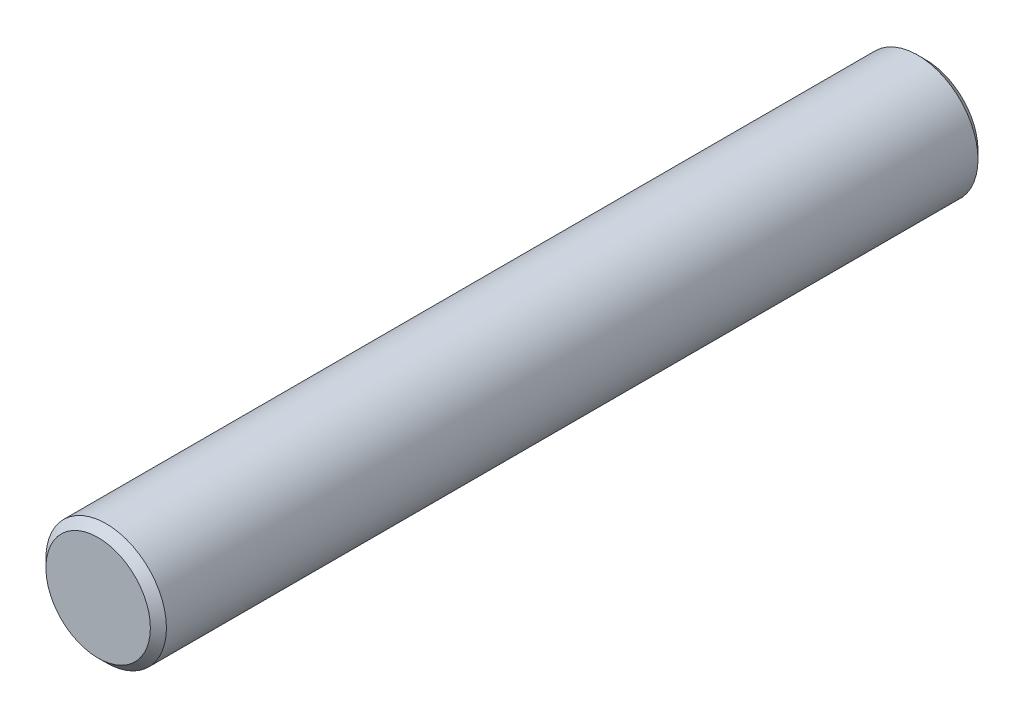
from build123d import *

# Parameters (mm, degrees)
ESQUISSE1_R        = 0.75
BOSS_EXTRU_1_DEPTH = 10.3
CHANFREIN1_SIZE    = 0.1


with BuildPart() as part:
    # Esquisse1 → Boss.-Extru.1 (new body)
    with BuildSketch(Plane.XY):
        Circle(ESQUISSE1_R)
    extrude(amount=BOSS_EXTRU_1_DEPTH)

    # Chanfrein1
    chanfrein1_edges = [part.edges().sort_by_distance(p)[0] for p in [
        (-0.75, 0, 0),
        (-0.75, 0, 10.3),
    ]]
    chamfer(chanfrein1_edges, length=CHANFREIN1_SIZE)


solid = part.part
